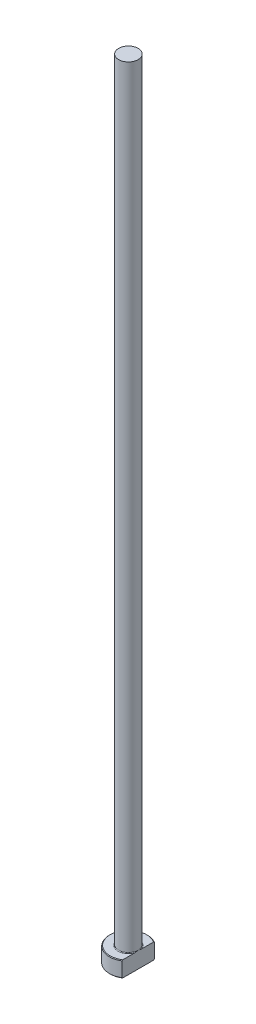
ISO-10303-21;
HEADER;
FILE_DESCRIPTION(('STEP AP214'),'2;1');
FILE_NAME('part.step','',(''),(''),'','','');
FILE_SCHEMA(('AUTOMOTIVE_DESIGN { 1 0 10303 214 1 1 1 1 }'));
ENDSEC;
DATA;
#1=APPLICATION_CONTEXT('core data for automotive mechanical design processes');
#2=APPLICATION_PROTOCOL_DEFINITION('international standard','automotive_design',2000,#1);
#3=PRODUCT_CONTEXT('',#1,'mechanical');
#4=PRODUCT('Part','Part','',(#3));
#5=PRODUCT_RELATED_PRODUCT_CATEGORY('part','',(#4));
#6=PRODUCT_DEFINITION_FORMATION('','',#4);
#7=PRODUCT_DEFINITION_CONTEXT('part definition',#1,'design');
#8=PRODUCT_DEFINITION('design','',#6,#7);
#9=PRODUCT_DEFINITION_SHAPE('','',#8);
#10=(LENGTH_UNIT() NAMED_UNIT(*) SI_UNIT(.MILLI.,.METRE.));
#11=(NAMED_UNIT(*) PLANE_ANGLE_UNIT() SI_UNIT($,.RADIAN.));
#12=(NAMED_UNIT(*) SI_UNIT($,.STERADIAN.) SOLID_ANGLE_UNIT());
#13=UNCERTAINTY_MEASURE_WITH_UNIT(LENGTH_MEASURE(1.E-05),#10,'distance_accuracy_value','');
#14=(GEOMETRIC_REPRESENTATION_CONTEXT(3) GLOBAL_UNCERTAINTY_ASSIGNED_CONTEXT((#13)) GLOBAL_UNIT_ASSIGNED_CONTEXT((#10,
#11,#12)) REPRESENTATION_CONTEXT('',''));
#15=CARTESIAN_POINT('',(0.,0.,0.));
#16=DIRECTION('',(0.,0.,1.));
#17=DIRECTION('',(1.,0.,0.));
#18=AXIS2_PLACEMENT_3D('',#15,#16,#17);
#19=CARTESIAN_POINT('',(0.,0.,0.));
#20=DIRECTION('',(0.,-1.,0.));
#21=DIRECTION('',(0.,0.,-1.));
#22=AXIS2_PLACEMENT_3D('',#19,#20,#21);
#23=PLANE('',#22);
#24=CARTESIAN_POINT('',(0.,0.,0.));
#25=DIRECTION('',(0.,-1.,0.));
#26=DIRECTION('',(0.,0.,-1.));
#27=AXIS2_PLACEMENT_3D('',#24,#25,#26);
#28=CIRCLE('',#27,5.79999999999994);
#29=CARTESIAN_POINT('',(3.09999999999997,0.,4.90204039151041));
#30=VERTEX_POINT('',#29);
#31=CARTESIAN_POINT('',(3.09999999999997,0.,-4.90204039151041));
#32=VERTEX_POINT('',#31);
#33=EDGE_CURVE('E98',#30,#32,#28,.T.);
#34=ORIENTED_EDGE('',*,*,#33,.T.);
#35=DIRECTION('',(0.,0.,1.));
#36=VECTOR('',#35,1.);
#37=CARTESIAN_POINT('',(3.09999999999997,0.,-5.13711981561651));
#38=LINE('',#37,#36);
#39=EDGE_CURVE('E83',#32,#30,#38,.T.);
#40=ORIENTED_EDGE('',*,*,#39,.T.);
#41=EDGE_LOOP('',(#34,#40));
#42=FACE_BOUND('',#41,.T.);
#43=ADVANCED_FACE('F32',(#42),#23,.T.);
#44=CARTESIAN_POINT('',(0.,259.958771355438,0.));
#45=DIRECTION('',(0.,1.,0.));
#46=DIRECTION('',(0.,0.,1.));
#47=AXIS2_PLACEMENT_3D('',#44,#45,#46);
#48=CYLINDRICAL_SURFACE('',#47,5.99999999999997);
#49=CARTESIAN_POINT('',(0.,4.80000000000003,0.));
#50=DIRECTION('',(0.,1.,0.));
#51=DIRECTION('',(0.,0.,1.));
#52=AXIS2_PLACEMENT_3D('',#49,#50,#51);
#53=CIRCLE('',#52,5.99999999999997);
#54=CARTESIAN_POINT('',(3.09999999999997,4.80000000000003,5.13711981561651));
#55=VERTEX_POINT('',#54);
#56=CARTESIAN_POINT('',(3.09999999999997,4.80000000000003,-5.13711981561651));
#57=VERTEX_POINT('',#56);
#58=EDGE_CURVE('E104',#55,#57,#53,.F.);
#59=ORIENTED_EDGE('',*,*,#58,.T.);
#60=DIRECTION('',(0.,-1.,0.));
#61=VECTOR('',#60,1.);
#62=CARTESIAN_POINT('',(3.09999999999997,250.,-5.13711981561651));
#63=LINE('',#62,#61);
#64=CARTESIAN_POINT('',(3.09999999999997,0.200000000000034,-5.13711981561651));
#65=VERTEX_POINT('',#64);
#66=EDGE_CURVE('E183',#57,#65,#63,.T.);
#67=ORIENTED_EDGE('',*,*,#66,.T.);
#68=CARTESIAN_POINT('',(0.,0.200000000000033,0.));
#69=DIRECTION('',(0.,-1.,0.));
#70=DIRECTION('',(0.,0.,-1.));
#71=AXIS2_PLACEMENT_3D('',#68,#69,#70);
#72=CIRCLE('',#71,5.99999999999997);
#73=CARTESIAN_POINT('',(3.09999999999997,0.200000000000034,5.13711981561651));
#74=VERTEX_POINT('',#73);
#75=EDGE_CURVE('E100',#65,#74,#72,.F.);
#76=ORIENTED_EDGE('',*,*,#75,.T.);
#77=DIRECTION('',(0.,-1.,0.));
#78=VECTOR('',#77,1.);
#79=CARTESIAN_POINT('',(3.09999999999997,250.,5.13711981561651));
#80=LINE('',#79,#78);
#81=EDGE_CURVE('E93',#55,#74,#80,.T.);
#82=ORIENTED_EDGE('',*,*,#81,.F.);
#83=EDGE_LOOP('',(#59,#67,#76,#82));
#84=FACE_BOUND('',#83,.T.);
#85=ADVANCED_FACE('F158',(#84),#48,.T.);
#86=CARTESIAN_POINT('',(-5.99999999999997,5.,0.));
#87=DIRECTION('',(0.,1.,0.));
#88=DIRECTION('',(0.,0.,1.));
#89=AXIS2_PLACEMENT_3D('',#86,#87,#88);
#90=PLANE('',#89);
#91=CARTESIAN_POINT('',(0.,5.,0.));
#92=DIRECTION('',(0.,1.,0.));
#93=DIRECTION('',(0.,0.,1.));
#94=AXIS2_PLACEMENT_3D('',#91,#92,#93);
#95=CIRCLE('',#94,5.79999999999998);
#96=CARTESIAN_POINT('',(3.09999999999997,5.,-4.90204039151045));
#97=VERTEX_POINT('',#96);
#98=CARTESIAN_POINT('',(3.09999999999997,5.,4.90204039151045));
#99=VERTEX_POINT('',#98);
#100=EDGE_CURVE('E178',#97,#99,#95,.T.);
#101=ORIENTED_EDGE('',*,*,#100,.T.);
#102=DIRECTION('',(0.,0.,-1.));
#103=VECTOR('',#102,1.);
#104=CARTESIAN_POINT('',(3.09999999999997,5.,0.));
#105=LINE('',#104,#103);
#106=CARTESIAN_POINT('',(3.09999999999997,4.99999999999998,1.13137084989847));
#107=VERTEX_POINT('',#106);
#108=EDGE_CURVE('E57',#99,#107,#105,.T.);
#109=ORIENTED_EDGE('',*,*,#108,.T.);
#110=CARTESIAN_POINT('',(0.,5.,0.));
#111=DIRECTION('',(0.,1.,0.));
#112=DIRECTION('',(0.,0.,1.));
#113=AXIS2_PLACEMENT_3D('',#110,#111,#112);
#114=CIRCLE('',#113,3.29999999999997);
#115=CARTESIAN_POINT('',(3.09999999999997,4.99999999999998,-1.13137084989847));
#116=VERTEX_POINT('',#115);
#117=EDGE_CURVE('E107',#107,#116,#114,.F.);
#118=ORIENTED_EDGE('',*,*,#117,.T.);
#119=EDGE_CURVE('E136',#116,#97,#105,.T.);
#120=ORIENTED_EDGE('',*,*,#119,.T.);
#121=EDGE_LOOP('',(#101,#109,#118,#120));
#122=FACE_BOUND('',#121,.T.);
#123=ADVANCED_FACE('F147',(#122),#90,.T.);
#124=CARTESIAN_POINT('',(0.,5.,0.));
#125=DIRECTION('',(0.,-1.,0.));
#126=DIRECTION('',(0.,0.,-1.));
#127=AXIS2_PLACEMENT_3D('',#124,#125,#126);
#128=CONICAL_SURFACE('',#127,5.79999999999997,0.785398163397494);
#129=ORIENTED_EDGE('',*,*,#58,.F.);
#130=CARTESIAN_POINT('',(3.09999999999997,-0.920431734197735,11.3030314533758));
#131=CARTESIAN_POINT('',(3.09999999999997,-0.688619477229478,11.0626468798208));
#132=CARTESIAN_POINT('',(3.09999999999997,-0.457063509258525,10.8220144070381));
#133=CARTESIAN_POINT('',(3.09999999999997,0.00539791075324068,10.3401205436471));
#134=CARTESIAN_POINT('',(3.09999999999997,0.236303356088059,10.0988591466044));
#135=CARTESIAN_POINT('',(3.09999999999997,0.69741098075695,9.61548494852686));
#136=CARTESIAN_POINT('',(3.09999999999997,0.927612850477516,9.3733718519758));
#137=CARTESIAN_POINT('',(3.09999999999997,1.38702344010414,8.88820676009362));
#138=CARTESIAN_POINT('',(3.09999999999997,1.61623216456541,8.64515476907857));
#139=CARTESIAN_POINT('',(3.09999999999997,2.06943803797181,8.16208218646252));
#140=CARTESIAN_POINT('',(3.09999999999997,2.29345676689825,7.92208185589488));
#141=CARTESIAN_POINT('',(3.09999999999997,2.73992554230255,7.4406269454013));
#142=CARTESIAN_POINT('',(3.09999999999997,2.96237559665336,7.19917237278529));
#143=CARTESIAN_POINT('',(3.09999999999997,3.40516728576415,6.71440911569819));
#144=CARTESIAN_POINT('',(3.09999999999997,3.6255092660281,6.47110074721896));
#145=CARTESIAN_POINT('',(3.09999999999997,4.06338097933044,5.98197014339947));
#146=CARTESIAN_POINT('',(3.09999999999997,4.28091078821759,5.736147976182));
#147=CARTESIAN_POINT('',(3.09999999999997,4.64723250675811,5.31542741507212));
#148=CARTESIAN_POINT('',(3.09999999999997,4.79703819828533,5.14141294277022));
#149=CARTESIAN_POINT('',(3.09999999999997,5.09412273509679,4.7912056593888));
#150=CARTESIAN_POINT('',(3.09999999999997,5.24140133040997,4.61501263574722));
#151=CARTESIAN_POINT('',(3.09999999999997,5.5340047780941,4.25808346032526));
#152=CARTESIAN_POINT('',(3.09999999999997,5.67929603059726,4.07731963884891));
#153=CARTESIAN_POINT('',(3.09999999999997,5.96506147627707,3.71208453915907));
#154=CARTESIAN_POINT('',(3.09999999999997,6.10553688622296,3.52761421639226));
#155=CARTESIAN_POINT('',(3.09999999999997,6.38162972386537,3.15098880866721));
#156=CARTESIAN_POINT('',(3.09999999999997,6.5171507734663,2.95876205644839));
#157=CARTESIAN_POINT('',(3.09999999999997,6.71260042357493,2.66498269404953));
#158=CARTESIAN_POINT('',(3.09999999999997,6.77649142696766,2.56607098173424));
#159=CARTESIAN_POINT('',(3.09999999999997,6.90093996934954,2.36617934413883));
#160=CARTESIAN_POINT('',(3.09999999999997,6.96149785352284,2.26519963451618));
#161=CARTESIAN_POINT('',(3.09999999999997,7.07778312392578,2.06197879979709));
#162=CARTESIAN_POINT('',(3.09999999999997,7.13355741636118,1.9597648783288));
#163=CARTESIAN_POINT('',(3.09999999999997,7.23993773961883,1.75269687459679));
#164=CARTESIAN_POINT('',(3.09999999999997,7.29054278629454,1.64784229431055));
#165=CARTESIAN_POINT('',(3.09999999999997,7.43232844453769,1.329374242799));
#166=CARTESIAN_POINT('',(3.09999999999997,7.51393038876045,1.11110705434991));
#167=CARTESIAN_POINT('',(3.09999999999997,7.60389052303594,0.78418122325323));
#168=CARTESIAN_POINT('',(3.09999999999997,7.62802295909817,0.679829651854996));
#169=CARTESIAN_POINT('',(3.09999999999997,7.66638713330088,0.46928482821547));
#170=CARTESIAN_POINT('',(3.09999999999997,7.68061997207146,0.363091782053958));
#171=CARTESIAN_POINT('',(3.09999999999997,7.69816738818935,0.150218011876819));
#172=CARTESIAN_POINT('',(3.09999999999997,7.70152516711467,0.0435409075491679));
#173=CARTESIAN_POINT('',(3.09999999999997,7.69719360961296,-0.169591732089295));
#174=CARTESIAN_POINT('',(3.09999999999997,7.68950359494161,-0.276047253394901));
#175=CARTESIAN_POINT('',(3.09999999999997,7.66373252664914,-0.486880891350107));
#176=CARTESIAN_POINT('',(3.09999999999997,7.64572733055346,-0.591268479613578));
#177=CARTESIAN_POINT('',(3.09999999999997,7.60052536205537,-0.798013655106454));
#178=CARTESIAN_POINT('',(3.09999999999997,7.57332729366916,-0.900370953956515));
#179=CARTESIAN_POINT('',(3.09999999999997,7.51094394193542,-1.10330613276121));
#180=CARTESIAN_POINT('',(3.09999999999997,7.47570859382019,-1.20386840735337));
#181=CARTESIAN_POINT('',(3.09999999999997,7.39875968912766,-1.40242722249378));
#182=CARTESIAN_POINT('',(3.09999999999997,7.35704736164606,-1.50042424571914));
#183=CARTESIAN_POINT('',(3.09999999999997,7.22811120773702,-1.78198575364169));
#184=CARTESIAN_POINT('',(3.09999999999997,7.13397777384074,-1.96237556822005));
#185=CARTESIAN_POINT('',(3.09999999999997,6.93309444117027,-2.31605883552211));
#186=CARTESIAN_POINT('',(3.09999999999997,6.82632930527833,-2.48934337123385));
#187=CARTESIAN_POINT('',(3.09999999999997,6.60386158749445,-2.83097436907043));
#188=CARTESIAN_POINT('',(3.09999999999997,6.48812633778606,-2.99929937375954));
#189=CARTESIAN_POINT('',(3.09999999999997,6.2507350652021,-3.33155975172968));
#190=CARTESIAN_POINT('',(3.09999999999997,6.12908188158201,-3.49549717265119));
#191=CARTESIAN_POINT('',(3.09999999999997,5.87989164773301,-3.82213838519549));
#192=CARTESIAN_POINT('',(3.09999999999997,5.75229938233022,-3.98479985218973));
#193=CARTESIAN_POINT('',(3.09999999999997,5.49383773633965,-4.30751445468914));
#194=CARTESIAN_POINT('',(3.09999999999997,5.36296802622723,-4.46756732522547));
#195=CARTESIAN_POINT('',(3.09999999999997,5.09906242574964,-4.78523580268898));
#196=CARTESIAN_POINT('',(3.09999999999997,4.96603235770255,-4.94285625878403));
#197=CARTESIAN_POINT('',(3.09999999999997,4.69805373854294,-5.25645943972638));
#198=CARTESIAN_POINT('',(3.09999999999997,4.56310515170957,-5.41244213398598));
#199=CARTESIAN_POINT('',(3.09999999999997,4.2080943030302,-5.81877937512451));
#200=CARTESIAN_POINT('',(3.09999999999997,3.98681570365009,-6.06807041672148));
#201=CARTESIAN_POINT('',(3.09999999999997,3.54147161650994,-6.56415415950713));
#202=CARTESIAN_POINT('',(3.09999999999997,3.31740605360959,-6.8109467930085));
#203=CARTESIAN_POINT('',(3.09999999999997,2.86701901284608,-7.30287446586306));
#204=CARTESIAN_POINT('',(3.09999999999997,2.64069567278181,-7.54800779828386));
#205=CARTESIAN_POINT('',(3.09999999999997,2.18649425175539,-8.0368296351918));
#206=CARTESIAN_POINT('',(3.09999999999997,1.95861616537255,-8.28051813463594));
#207=CARTESIAN_POINT('',(3.09999999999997,1.5108345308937,-8.75699429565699));
#208=CARTESIAN_POINT('',(3.09999999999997,1.29097841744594,-8.98982656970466));
#209=CARTESIAN_POINT('',(3.09999999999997,0.850379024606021,-9.4546514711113));
#210=CARTESIAN_POINT('',(3.09999999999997,0.629635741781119,-9.68664409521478));
#211=CARTESIAN_POINT('',(3.09999999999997,0.187673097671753,-10.1496925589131));
#212=CARTESIAN_POINT('',(3.09999999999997,-0.0335454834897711,-10.3807491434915));
#213=CARTESIAN_POINT('',(3.09999999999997,-0.476574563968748,-10.8422904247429));
#214=CARTESIAN_POINT('',(3.09999999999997,-0.698385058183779,-11.0727751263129));
#215=CARTESIAN_POINT('',(3.09999999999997,-0.920431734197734,-11.3030314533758));
#216=B_SPLINE_CURVE_WITH_KNOTS('',3,(#130,#131,#132,#133,#134,#135,#136,#137,#138,#139,#140,
#141,#142,#143,#144,#145,#146,#147,#148,#149,#150,#151,#152,#153,#154,#155,#156,#157,#158,#159,
#160,#161,#162,#163,#164,#165,#166,#167,#168,#169,#170,#171,#172,#173,#174,#175,#176,#177,#178,
#179,#180,#181,#182,#183,#184,#185,#186,#187,#188,#189,#190,#191,#192,#193,#194,#195,#196,#197,
#198,#199,#200,#201,#202,#203,#204,#205,#206,#207,#208,#209,#210,#211,#212,#213,#214,#215),
.UNSPECIFIED.,.F.,.F.,(4,2,2,2,2,2,2,2,2,2,2,2,2,2,2,2,2,2,2,2,2,2,2,2,2,2,2,2,2,2,2,2,2,2,2,2,
2,2,2,2,2,2,4),(0.,1.00184641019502,2.00370311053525,3.00595078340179,4.00819385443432,
4.9931053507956,5.97801190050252,6.9627541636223,7.94746981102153,8.6362949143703,
9.32518776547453,10.0208755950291,10.7163863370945,11.421700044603,11.7749044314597,
12.1280721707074,12.4772435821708,12.8264813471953,13.5223439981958,13.8432758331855,
14.1641719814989,14.4837917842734,14.8034312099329,15.1207496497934,15.4381128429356,
15.7575096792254,16.0768459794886,16.6863983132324,17.296693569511,17.9093265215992,
18.5216683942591,19.1418114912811,19.7620171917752,20.3807633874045,20.9995211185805,
21.9994842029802,22.9994743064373,24.0003716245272,25.0012724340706,25.961961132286,
26.9226535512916,27.882299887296,28.8419379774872),.UNSPECIFIED.);
#217=EDGE_CURVE('E135',#55,#99,#216,.T.);
#218=ORIENTED_EDGE('',*,*,#217,.T.);
#219=ORIENTED_EDGE('',*,*,#100,.F.);
#220=EDGE_CURVE('E127',#97,#57,#216,.T.);
#221=ORIENTED_EDGE('',*,*,#220,.T.);
#222=EDGE_LOOP('',(#129,#218,#219,#221));
#223=FACE_BOUND('',#222,.T.);
#224=ADVANCED_FACE('F143',(#223),#128,.T.);
#225=CARTESIAN_POINT('',(0.,0.200000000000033,0.));
#226=DIRECTION('',(0.,1.,0.));
#227=DIRECTION('',(0.,0.,1.));
#228=AXIS2_PLACEMENT_3D('',#225,#226,#227);
#229=CONICAL_SURFACE('',#228,5.99999999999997,0.785398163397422);
#230=ORIENTED_EDGE('',*,*,#75,.F.);
#231=CARTESIAN_POINT('',(3.09999999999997,5.92043173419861,-11.3030314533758));
#232=CARTESIAN_POINT('',(3.09999999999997,5.68861947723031,-11.0626468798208));
#233=CARTESIAN_POINT('',(3.09999999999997,5.4570635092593,-10.822014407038));
#234=CARTESIAN_POINT('',(3.09999999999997,4.99460208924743,-10.340120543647));
#235=CARTESIAN_POINT('',(3.09999999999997,4.76369664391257,-10.0988591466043));
#236=CARTESIAN_POINT('',(3.09999999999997,4.30258901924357,-9.61548494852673));
#237=CARTESIAN_POINT('',(3.09999999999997,4.07238714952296,-9.37337185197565));
#238=CARTESIAN_POINT('',(3.09999999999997,3.61297655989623,-8.88820676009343));
#239=CARTESIAN_POINT('',(3.09999999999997,3.38376783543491,-8.64515476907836));
#240=CARTESIAN_POINT('',(3.09999999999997,2.93056196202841,-8.16208218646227));
#241=CARTESIAN_POINT('',(3.09999999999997,2.70654323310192,-7.92208185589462));
#242=CARTESIAN_POINT('',(3.09999999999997,2.26007445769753,-7.44062694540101));
#243=CARTESIAN_POINT('',(3.09999999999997,2.03762440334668,-7.19917237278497));
#244=CARTESIAN_POINT('',(3.09999999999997,1.59483271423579,-6.71440911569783));
#245=CARTESIAN_POINT('',(3.09999999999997,1.3744907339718,-6.47110074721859));
#246=CARTESIAN_POINT('',(3.09999999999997,0.936619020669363,-5.98197014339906));
#247=CARTESIAN_POINT('',(3.09999999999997,0.71908921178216,-5.73614797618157));
#248=CARTESIAN_POINT('',(3.09999999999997,0.352767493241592,-5.31542741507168));
#249=CARTESIAN_POINT('',(3.09999999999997,0.202961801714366,-5.1414129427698));
#250=CARTESIAN_POINT('',(3.09999999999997,-0.094122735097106,-4.7912056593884));
#251=CARTESIAN_POINT('',(3.09999999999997,-0.241401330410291,-4.61501263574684));
#252=CARTESIAN_POINT('',(3.09999999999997,-0.534004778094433,-4.25808346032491));
#253=CARTESIAN_POINT('',(3.09999999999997,-0.679296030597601,-4.07731963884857));
#254=CARTESIAN_POINT('',(3.09999999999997,-0.965061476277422,-3.71208453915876));
#255=CARTESIAN_POINT('',(3.09999999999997,-1.10553688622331,-3.52761421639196));
#256=CARTESIAN_POINT('',(3.09999999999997,-1.38162972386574,-3.15098880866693));
#257=CARTESIAN_POINT('',(3.09999999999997,-1.51715077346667,-2.95876205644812));
#258=CARTESIAN_POINT('',(3.09999999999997,-1.71260042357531,-2.66498269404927));
#259=CARTESIAN_POINT('',(3.09999999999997,-1.77649142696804,-2.56607098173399));
#260=CARTESIAN_POINT('',(3.09999999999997,-1.90093996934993,-2.36617934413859));
#261=CARTESIAN_POINT('',(3.09999999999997,-1.96149785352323,-2.26519963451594));
#262=CARTESIAN_POINT('',(3.09999999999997,-2.07778312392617,-2.06197879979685));
#263=CARTESIAN_POINT('',(3.09999999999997,-2.13355741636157,-1.95976487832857));
#264=CARTESIAN_POINT('',(3.09999999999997,-2.23993773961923,-1.75269687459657));
#265=CARTESIAN_POINT('',(3.09999999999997,-2.29054278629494,-1.64784229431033));
#266=CARTESIAN_POINT('',(3.09999999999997,-2.43232844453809,-1.3293742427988));
#267=CARTESIAN_POINT('',(3.09999999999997,-2.51393038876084,-1.11110705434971));
#268=CARTESIAN_POINT('',(3.09999999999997,-2.60389052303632,-0.784181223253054));
#269=CARTESIAN_POINT('',(3.09999999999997,-2.62802295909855,-0.679829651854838));
#270=CARTESIAN_POINT('',(3.09999999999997,-2.66638713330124,-0.46928482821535));
#271=CARTESIAN_POINT('',(3.09999999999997,-2.68061997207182,-0.363091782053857));
#272=CARTESIAN_POINT('',(3.09999999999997,-2.69816738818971,-0.150218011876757));
#273=CARTESIAN_POINT('',(3.09999999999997,-2.70152516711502,-0.0435409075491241));
#274=CARTESIAN_POINT('',(3.09999999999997,-2.69719360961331,0.1695917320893));
#275=CARTESIAN_POINT('',(3.09999999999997,-2.68950359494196,0.276047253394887));
#276=CARTESIAN_POINT('',(3.09999999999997,-2.6637325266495,0.486880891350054));
#277=CARTESIAN_POINT('',(3.09999999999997,-2.64572733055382,0.591268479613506));
#278=CARTESIAN_POINT('',(3.09999999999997,-2.60052536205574,0.798013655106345));
#279=CARTESIAN_POINT('',(3.09999999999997,-2.57332729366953,0.900370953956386));
#280=CARTESIAN_POINT('',(3.09999999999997,-2.51094394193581,1.10330613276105));
#281=CARTESIAN_POINT('',(3.09999999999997,-2.47570859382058,1.20386840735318));
#282=CARTESIAN_POINT('',(3.09999999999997,-2.39875968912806,1.40242722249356));
#283=CARTESIAN_POINT('',(3.09999999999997,-2.35704736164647,1.5004242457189));
#284=CARTESIAN_POINT('',(3.09999999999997,-2.22811120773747,1.78198575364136));
#285=CARTESIAN_POINT('',(3.09999999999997,-2.13397777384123,1.96237556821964));
#286=CARTESIAN_POINT('',(3.09999999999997,-1.93309444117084,2.31605883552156));
#287=CARTESIAN_POINT('',(3.09999999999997,-1.82632930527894,2.48934337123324));
#288=CARTESIAN_POINT('',(3.09999999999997,-1.60386158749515,2.83097436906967));
#289=CARTESIAN_POINT('',(3.09999999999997,-1.48812633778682,2.99929937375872));
#290=CARTESIAN_POINT('',(3.09999999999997,-1.25073506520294,3.33155975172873));
#291=CARTESIAN_POINT('',(3.09999999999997,-1.1290818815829,3.49549717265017));
#292=CARTESIAN_POINT('',(3.09999999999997,-0.879891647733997,3.82213838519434));
#293=CARTESIAN_POINT('',(3.09999999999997,-0.752299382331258,3.98479985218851));
#294=CARTESIAN_POINT('',(3.09999999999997,-0.493837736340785,4.30751445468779));
#295=CARTESIAN_POINT('',(3.09999999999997,-0.362968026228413,4.46756732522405));
#296=CARTESIAN_POINT('',(3.09999999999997,-0.0990624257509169,4.78523580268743));
#297=CARTESIAN_POINT('',(3.09999999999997,0.033967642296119,4.94285625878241));
#298=CARTESIAN_POINT('',(3.09999999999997,0.301946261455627,5.25645943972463));
#299=CARTESIAN_POINT('',(3.09999999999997,0.436894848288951,5.41244213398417));
#300=CARTESIAN_POINT('',(3.09999999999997,0.791905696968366,5.81877937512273));
#301=CARTESIAN_POINT('',(3.09999999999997,1.01318429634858,6.06807041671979));
#302=CARTESIAN_POINT('',(3.09999999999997,1.45852838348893,6.56415415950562));
#303=CARTESIAN_POINT('',(3.09999999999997,1.68259394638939,6.81094679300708));
#304=CARTESIAN_POINT('',(3.09999999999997,2.13298098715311,7.30287446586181));
#305=CARTESIAN_POINT('',(3.09999999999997,2.35930432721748,7.54800779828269));
#306=CARTESIAN_POINT('',(3.09999999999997,2.81350574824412,8.03682963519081));
#307=CARTESIAN_POINT('',(3.09999999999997,3.04138383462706,8.28051813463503));
#308=CARTESIAN_POINT('',(3.09999999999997,3.48916546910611,8.75699429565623));
#309=CARTESIAN_POINT('',(3.09999999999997,3.70902158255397,8.98982656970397));
#310=CARTESIAN_POINT('',(3.09999999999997,4.14962097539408,9.45465147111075));
#311=CARTESIAN_POINT('',(3.09999999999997,4.37036425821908,9.6866440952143));
#312=CARTESIAN_POINT('',(3.09999999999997,4.81232690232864,10.1496925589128));
#313=CARTESIAN_POINT('',(3.09999999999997,5.03354548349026,10.3807491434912));
#314=CARTESIAN_POINT('',(3.09999999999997,5.47657456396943,10.8422904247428));
#315=CARTESIAN_POINT('',(3.09999999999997,5.69838505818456,11.0727751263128));
#316=CARTESIAN_POINT('',(3.09999999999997,5.92043173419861,11.3030314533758));
#317=B_SPLINE_CURVE_WITH_KNOTS('',3,(#231,#232,#233,#234,#235,#236,#237,#238,#239,#240,#241,
#242,#243,#244,#245,#246,#247,#248,#249,#250,#251,#252,#253,#254,#255,#256,#257,#258,#259,#260,
#261,#262,#263,#264,#265,#266,#267,#268,#269,#270,#271,#272,#273,#274,#275,#276,#277,#278,#279,
#280,#281,#282,#283,#284,#285,#286,#287,#288,#289,#290,#291,#292,#293,#294,#295,#296,#297,#298,
#299,#300,#301,#302,#303,#304,#305,#306,#307,#308,#309,#310,#311,#312,#313,#314,#315,#316),
.UNSPECIFIED.,.F.,.F.,(4,2,2,2,2,2,2,2,2,2,2,2,2,2,2,2,2,2,2,2,2,2,2,2,2,2,2,2,2,2,2,2,2,2,2,2,
2,2,2,2,2,2,4),(0.,1.00184641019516,2.00370311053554,3.00595078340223,4.00819385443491,
4.99310535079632,5.97801190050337,6.96275416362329,7.94746981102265,8.6362949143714,
9.32518776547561,10.0208755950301,10.7163863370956,11.421700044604,11.7749044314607,
12.1280721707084,12.4772435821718,12.8264813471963,13.5223439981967,13.8432758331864,
14.1641719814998,14.4837917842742,14.8034312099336,15.1207496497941,15.4381128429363,
15.757509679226,16.0768459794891,16.6863983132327,17.2966935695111,17.909326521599,
18.5216683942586,19.1418114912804,19.7620171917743,20.3807633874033,20.999521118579,
21.9994842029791,22.9994743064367,24.000371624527,25.0012724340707,25.9619611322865,
26.9226535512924,27.8822998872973,28.8419379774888),.UNSPECIFIED.);
#318=EDGE_CURVE('E86',#65,#32,#317,.T.);
#319=ORIENTED_EDGE('',*,*,#318,.T.);
#320=ORIENTED_EDGE('',*,*,#33,.F.);
#321=EDGE_CURVE('E89',#30,#74,#317,.T.);
#322=ORIENTED_EDGE('',*,*,#321,.T.);
#323=EDGE_LOOP('',(#230,#319,#320,#322));
#324=FACE_BOUND('',#323,.T.);
#325=ADVANCED_FACE('F97',(#324),#229,.T.);
#326=CARTESIAN_POINT('',(0.,5.19999999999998,0.));
#327=DIRECTION('',(0.,1.,0.));
#328=DIRECTION('',(0.,0.,1.));
#329=AXIS2_PLACEMENT_3D('',#326,#327,#328);
#330=TOROIDAL_SURFACE('',#329,3.29999999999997,0.2);
#331=CARTESIAN_POINT('',(3.09999999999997,5.19999999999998,0.));
#332=CARTESIAN_POINT('',(3.09999999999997,5.20000050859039,8.63470448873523E-11));
#333=CARTESIAN_POINT('',(3.09999999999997,5.20000101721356,-1.96831350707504E-07));
#334=CARTESIAN_POINT('',(3.09999999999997,5.20000196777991,-7.43387548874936E-07));
#335=CARTESIAN_POINT('',(3.09999999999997,5.20000239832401,-1.10608751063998E-06));
#336=CARTESIAN_POINT('',(3.09999999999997,5.20000329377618,-1.97482885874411E-06));
#337=CARTESIAN_POINT('',(3.09999999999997,5.20000374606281,-2.49491365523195E-06));
#338=CARTESIAN_POINT('',(3.09999999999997,5.20000455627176,-3.57320004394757E-06));
#339=CARTESIAN_POINT('',(3.09999999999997,5.20000491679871,-4.12959627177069E-06));
#340=CARTESIAN_POINT('',(3.09999999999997,5.20000625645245,-6.28443543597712E-06));
#341=CARTESIAN_POINT('',(3.09999999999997,5.20000716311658,-7.93057681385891E-06));
#342=CARTESIAN_POINT('',(3.09999999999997,5.20000865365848,-1.11908861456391E-05));
#343=CARTESIAN_POINT('',(3.09999999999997,5.20000925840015,-1.27959111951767E-05));
#344=CARTESIAN_POINT('',(3.09999999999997,5.20001179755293,-1.95895744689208E-05));
#345=CARTESIAN_POINT('',(3.09999999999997,5.20001369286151,-2.47960258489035E-05));
#346=CARTESIAN_POINT('',(3.09999999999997,5.20001648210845,-3.46313916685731E-05));
#347=CARTESIAN_POINT('',(3.09999999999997,5.20001748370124,-3.9229578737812E-05));
#348=CARTESIAN_POINT('',(3.09999999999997,5.20002478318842,-7.34062169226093E-05));
#349=CARTESIAN_POINT('',(3.09999999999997,5.20003031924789,-0.000103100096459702));
#350=CARTESIAN_POINT('',(3.09999999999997,5.20005455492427,-0.000220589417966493));
#351=CARTESIAN_POINT('',(3.09999999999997,5.2000776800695,-0.000307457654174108));
#352=CARTESIAN_POINT('',(3.09999999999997,5.20016786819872,-0.000651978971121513));
#353=CARTESIAN_POINT('',(3.09999999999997,5.20023206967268,-0.000910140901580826));
#354=CARTESIAN_POINT('',(3.09999999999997,5.2004894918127,-0.00193760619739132));
#355=CARTESIAN_POINT('',(3.09999999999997,5.20068632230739,-0.00270624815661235));
#356=CARTESIAN_POINT('',(3.09999999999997,5.20150547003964,-0.00591366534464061));
#357=CARTESIAN_POINT('',(3.09999999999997,5.20212323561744,-0.00835327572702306));
#358=CARTESIAN_POINT('',(3.09999999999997,5.2072994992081,-0.0287840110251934));
#359=CARTESIAN_POINT('',(3.09999999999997,5.21187465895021,-0.046772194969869));
#360=CARTESIAN_POINT('',(3.09999999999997,5.22081406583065,-0.0820386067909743));
#361=CARTESIAN_POINT('',(3.09999999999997,5.22517945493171,-0.0993165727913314));
#362=CARTESIAN_POINT('',(3.09999999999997,5.23938711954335,-0.155760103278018));
#363=CARTESIAN_POINT('',(3.09999999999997,5.24916620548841,-0.19494192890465));
#364=CARTESIAN_POINT('',(3.09999999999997,5.26559812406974,-0.262010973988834));
#365=CARTESIAN_POINT('',(3.09999999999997,5.27233495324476,-0.289877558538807));
#366=CARTESIAN_POINT('',(3.09999999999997,5.28539894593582,-0.344925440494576));
#367=CARTESIAN_POINT('',(3.09999999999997,5.2917322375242,-0.372105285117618));
#368=CARTESIAN_POINT('',(3.09999999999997,5.3104657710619,-0.454441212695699));
#369=CARTESIAN_POINT('',(3.09999999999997,5.32242624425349,-0.509699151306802));
#370=CARTESIAN_POINT('',(3.09999999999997,5.34470875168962,-0.621095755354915));
#371=CARTESIAN_POINT('',(3.09999999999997,5.35501420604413,-0.677237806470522));
#372=CARTESIAN_POINT('',(3.09999999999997,5.37397233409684,-0.795308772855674));
#373=CARTESIAN_POINT('',(3.09999999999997,5.38237372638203,-0.857279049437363));
#374=CARTESIAN_POINT('',(3.09999999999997,5.39483964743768,-0.981488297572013));
#375=CARTESIAN_POINT('',(3.09999999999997,5.39891956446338,-1.04372551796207));
#376=CARTESIAN_POINT('',(3.09999999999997,5.4002522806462,-1.1364625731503));
#377=CARTESIAN_POINT('',(3.09999999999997,5.39992868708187,-1.16692514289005));
#378=CARTESIAN_POINT('',(3.09999999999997,5.39736890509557,-1.22783403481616));
#379=CARTESIAN_POINT('',(3.09999999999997,5.39512949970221,-1.25828024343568));
#380=CARTESIAN_POINT('',(3.09999999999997,5.3882758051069,-1.31816284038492));
#381=CARTESIAN_POINT('',(3.09999999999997,5.38372059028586,-1.34760578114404));
#382=CARTESIAN_POINT('',(3.09999999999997,5.37149785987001,-1.40581436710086));
#383=CARTESIAN_POINT('',(3.09999999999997,5.36383981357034,-1.43458179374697));
#384=CARTESIAN_POINT('',(3.09999999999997,5.34913051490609,-1.47610977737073));
#385=CARTESIAN_POINT('',(3.09999999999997,5.34380195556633,-1.48947638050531));
#386=CARTESIAN_POINT('',(3.09999999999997,5.33179609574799,-1.51565425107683));
#387=CARTESIAN_POINT('',(3.09999999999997,5.32511527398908,-1.52846396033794));
#388=CARTESIAN_POINT('',(3.09999999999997,5.31156812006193,-1.55058530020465));
#389=CARTESIAN_POINT('',(3.09999999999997,5.30500876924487,-1.56008264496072));
#390=CARTESIAN_POINT('',(3.09999999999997,5.29056237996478,-1.5780097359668));
#391=CARTESIAN_POINT('',(3.09999999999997,5.28267975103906,-1.58644287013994));
#392=CARTESIAN_POINT('',(3.09999999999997,5.26899499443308,-1.59836257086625));
#393=CARTESIAN_POINT('',(3.09999999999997,5.26370979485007,-1.60243897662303));
#394=CARTESIAN_POINT('',(3.09999999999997,5.25259769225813,-1.60977856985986));
#395=CARTESIAN_POINT('',(3.09999999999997,5.24677147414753,-1.61304276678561));
#396=CARTESIAN_POINT('',(3.09999999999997,5.23558966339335,-1.61807105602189));
#397=CARTESIAN_POINT('',(3.09999999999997,5.23030479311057,-1.61999055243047));
#398=CARTESIAN_POINT('',(3.09999999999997,5.21948724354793,-1.62291762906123));
#399=CARTESIAN_POINT('',(3.09999999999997,5.21395478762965,-1.62392601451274));
#400=CARTESIAN_POINT('',(3.09999999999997,5.20277366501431,-1.62493544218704));
#401=CARTESIAN_POINT('',(3.09999999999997,5.19712461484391,-1.62493233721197));
#402=CARTESIAN_POINT('',(3.09999999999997,5.18591949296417,-1.62390846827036));
#403=CARTESIAN_POINT('',(3.09999999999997,5.1803634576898,-1.62288731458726));
#404=CARTESIAN_POINT('',(3.09999999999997,5.16982009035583,-1.62001450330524));
#405=CARTESIAN_POINT('',(3.09999999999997,5.16481843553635,-1.61821408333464));
#406=CARTESIAN_POINT('',(3.09999999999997,5.15512149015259,-1.61392929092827));
#407=CARTESIAN_POINT('',(3.09999999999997,5.15042629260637,-1.61144471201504));
#408=CARTESIAN_POINT('',(3.09999999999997,5.13843536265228,-1.60413057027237));
#409=CARTESIAN_POINT('',(3.09999999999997,5.13143004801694,-1.59882575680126));
#410=CARTESIAN_POINT('',(3.09999999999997,5.11831643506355,-1.5871999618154));
#411=CARTESIAN_POINT('',(3.09999999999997,5.1122112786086,-1.58087557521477));
#412=CARTESIAN_POINT('',(3.09999999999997,5.09648912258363,-1.56251896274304));
#413=CARTESIAN_POINT('',(3.09999999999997,5.08770172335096,-1.54978301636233));
#414=CARTESIAN_POINT('',(3.09999999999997,5.07201622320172,-1.52323986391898));
#415=CARTESIAN_POINT('',(3.09999999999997,5.06512028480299,-1.50943145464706));
#416=CARTESIAN_POINT('',(3.09999999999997,5.05247518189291,-1.48047677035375));
#417=CARTESIAN_POINT('',(3.09999999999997,5.04680124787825,-1.46529814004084));
#418=CARTESIAN_POINT('',(3.09999999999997,5.03672275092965,-1.43451819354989));
#419=CARTESIAN_POINT('',(3.09999999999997,5.03231964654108,-1.41891641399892));
#420=CARTESIAN_POINT('',(3.09999999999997,5.02058030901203,-1.37142005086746));
#421=CARTESIAN_POINT('',(3.09999999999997,5.01483238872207,-1.3391366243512));
#422=CARTESIAN_POINT('',(3.09999999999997,5.00376797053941,-1.25503165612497));
#423=CARTESIAN_POINT('',(3.09999999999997,5.00071471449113,-1.20294070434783));
#424=CARTESIAN_POINT('',(3.09999999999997,4.99950954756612,-1.09856941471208));
#425=CARTESIAN_POINT('',(3.09999999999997,5.00137734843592,-1.04628915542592));
#426=CARTESIAN_POINT('',(3.09999999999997,5.00844280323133,-0.944923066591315));
#427=CARTESIAN_POINT('',(3.09999999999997,5.01344756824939,-0.895822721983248));
#428=CARTESIAN_POINT('',(3.09999999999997,5.02575896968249,-0.798308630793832));
#429=CARTESIAN_POINT('',(3.09999999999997,5.03304750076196,-0.749892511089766));
#430=CARTESIAN_POINT('',(3.09999999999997,5.04953811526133,-0.652335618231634));
#431=CARTESIAN_POINT('',(3.09999999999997,5.05877753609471,-0.603201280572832));
#432=CARTESIAN_POINT('',(3.09999999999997,5.07884455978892,-0.503941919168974));
#433=CARTESIAN_POINT('',(3.09999999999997,5.08970698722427,-0.453824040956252));
#434=CARTESIAN_POINT('',(3.09999999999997,5.10895219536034,-0.369008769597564));
#435=CARTESIAN_POINT('',(3.09999999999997,5.11708529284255,-0.334253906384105));
#436=CARTESIAN_POINT('',(3.09999999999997,5.13360118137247,-0.265211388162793));
#437=CARTESIAN_POINT('',(3.09999999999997,5.14198019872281,-0.230922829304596));
#438=CARTESIAN_POINT('',(3.09999999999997,5.15798158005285,-0.16629806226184));
#439=CARTESIAN_POINT('',(3.09999999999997,5.16558151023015,-0.135956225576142));
#440=CARTESIAN_POINT('',(3.09999999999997,5.1812139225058,-0.0740081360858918));
#441=CARTESIAN_POINT('',(3.09999999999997,5.18925105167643,-0.0424030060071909));
#442=CARTESIAN_POINT('',(3.09999999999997,5.19787768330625,-0.0083493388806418));
#443=CARTESIAN_POINT('',(3.09999999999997,5.1984965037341,-0.00590581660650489));
#444=CARTESIAN_POINT('',(3.09999999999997,5.19931589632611,-0.00269751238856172));
#445=CARTESIAN_POINT('',(3.09999999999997,5.19951194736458,-0.00193190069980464));
#446=CARTESIAN_POINT('',(3.09999999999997,5.1997684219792,-0.000908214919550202));
#447=CARTESIAN_POINT('',(3.09999999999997,5.19983243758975,-0.000650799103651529));
#448=CARTESIAN_POINT('',(3.09999999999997,5.19992240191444,-0.00030714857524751));
#449=CARTESIAN_POINT('',(3.09999999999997,5.19994549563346,-0.000220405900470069));
#450=CARTESIAN_POINT('',(3.09999999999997,5.19996970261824,-0.000103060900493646));
#451=CARTESIAN_POINT('',(3.09999999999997,5.19997523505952,-7.33845004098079E-05));
#452=CARTESIAN_POINT('',(3.09999999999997,5.19998252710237,-3.92257131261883E-05));
#453=CARTESIAN_POINT('',(3.09999999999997,5.19998352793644,-3.462848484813E-05));
#454=CARTESIAN_POINT('',(3.09999999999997,5.1999863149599,-2.4795096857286E-05));
#455=CARTESIAN_POINT('',(3.09999999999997,5.19998820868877,-1.95896135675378E-05));
#456=CARTESIAN_POINT('',(3.09999999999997,5.19999074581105,-1.2796958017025E-05));
#457=CARTESIAN_POINT('',(3.09999999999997,5.1999913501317,-1.11920046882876E-05));
#458=CARTESIAN_POINT('',(3.09999999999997,5.19999283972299,-7.93177065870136E-06));
#459=CARTESIAN_POINT('',(3.09999999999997,5.19999374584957,-6.28562370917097E-06));
#460=CARTESIAN_POINT('',(3.09999999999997,5.19999508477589,-4.13069797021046E-06));
#461=CARTESIAN_POINT('',(3.09999999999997,5.1999954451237,-3.57425625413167E-06));
#462=CARTESIAN_POINT('',(3.09999999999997,5.19999625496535,-2.49584654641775E-06));
#463=CARTESIAN_POINT('',(3.09999999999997,5.19999670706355,-1.97568269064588E-06));
#464=CARTESIAN_POINT('',(3.09999999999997,5.19999760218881,-1.10675611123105E-06));
#465=CARTESIAN_POINT('',(3.09999999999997,5.19999803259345,-7.4395710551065E-07));
#466=CARTESIAN_POINT('',(3.09999999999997,5.19999898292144,-1.97149804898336E-07));
#467=CARTESIAN_POINT('',(3.09999999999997,5.19999949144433,-8.63411446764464E-11));
#468=CARTESIAN_POINT('',(3.09999999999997,5.19999999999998,0.));
#469=B_SPLINE_CURVE_WITH_KNOTS('',3,(#331,#332,#333,#334,#335,#336,#337,#338,#339,#340,#341,
#342,#343,#344,#345,#346,#347,#348,#349,#350,#351,#352,#353,#354,#355,#356,#357,#358,#359,#360,
#361,#362,#363,#364,#365,#366,#367,#368,#369,#370,#371,#372,#373,#374,#375,#376,#377,#378,#379,
#380,#381,#382,#383,#384,#385,#386,#387,#388,#389,#390,#391,#392,#393,#394,#395,#396,#397,#398,
#399,#400,#401,#402,#403,#404,#405,#406,#407,#408,#409,#410,#411,#412,#413,#414,#415,#416,#417,
#418,#419,#420,#421,#422,#423,#424,#425,#426,#427,#428,#429,#430,#431,#432,#433,#434,#435,#436,
#437,#438,#439,#440,#441,#442,#443,#444,#445,#446,#447,#448,#449,#450,#451,#452,#453,#454,#455,
#456,#457,#458,#459,#460,#461,#462,#463,#464,#465,#466,#467,#468),.UNSPECIFIED.,.T.,.F.,(4,2,2,
2,2,2,2,2,2,2,2,2,2,2,2,2,2,2,2,2,2,2,2,2,2,2,2,2,2,2,2,2,2,2,2,2,2,2,2,2,2,2,2,2,2,2,2,2,2,2,2,
2,2,2,2,2,2,2,2,2,2,2,2,2,2,2,2,2,4),(0.,1.53981331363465E-06,3.23033975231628E-06,
5.28553578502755E-06,7.27344647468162E-06,1.28910817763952E-05,1.8031960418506E-05,
3.46255039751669E-05,4.8726433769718E-05,0.000139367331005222,0.000408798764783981,
0.0012071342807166,0.00358714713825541,0.0111373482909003,0.0668184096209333,0.120281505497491,
0.241431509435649,0.327438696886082,0.411161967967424,0.580755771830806,0.751954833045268,
0.939477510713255,1.12633017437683,1.21767988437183,1.30918328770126,1.39846159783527,
1.48746947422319,1.53058836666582,1.57382101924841,1.60836719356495,1.64280045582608,
1.66276990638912,1.68271441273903,1.69951299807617,1.71629672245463,1.73314926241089,
1.75000825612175,1.76589594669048,1.78178843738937,1.80799762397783,1.83429622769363,
1.88045465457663,1.9266656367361,1.97520355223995,2.02379695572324,2.12194851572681,
2.27811623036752,2.43491043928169,2.58289937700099,2.7297435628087,2.87970504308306,
3.03353547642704,3.14061512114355,3.24650617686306,3.34034416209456,3.4381742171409,
3.44573655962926,3.44810718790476,3.44890321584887,3.44917225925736,3.44926284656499,
3.44927694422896,3.44929353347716,3.44929867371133,3.44930429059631,3.44930627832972,
3.44930833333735,3.44931002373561,3.4493115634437),.UNSPECIFIED.);
#470=CARTESIAN_POINT('',(3.09999999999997,5.19999999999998,0.));
#471=VERTEX_POINT('',#470);
#472=EDGE_CURVE('E11',#116,#471,#469,.T.);
#473=ORIENTED_EDGE('',*,*,#472,.F.);
#474=ORIENTED_EDGE('',*,*,#117,.F.);
#475=CARTESIAN_POINT('',(3.09999999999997,5.19999999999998,0.));
#476=CARTESIAN_POINT('',(3.09999999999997,5.19999949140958,-8.63470557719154E-11));
#477=CARTESIAN_POINT('',(3.09999999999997,5.19999898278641,1.96831350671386E-07));
#478=CARTESIAN_POINT('',(3.09999999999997,5.19999803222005,7.43387548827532E-07));
#479=CARTESIAN_POINT('',(3.09999999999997,5.19999760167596,1.10608751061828E-06));
#480=CARTESIAN_POINT('',(3.09999999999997,5.19999670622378,1.97482885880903E-06));
#481=CARTESIAN_POINT('',(3.09999999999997,5.19999625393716,2.49491365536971E-06));
#482=CARTESIAN_POINT('',(3.09999999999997,5.1999954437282,3.57320004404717E-06));
#483=CARTESIAN_POINT('',(3.09999999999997,5.19999508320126,4.12959627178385E-06));
#484=CARTESIAN_POINT('',(3.09999999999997,5.19999374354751,6.28443543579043E-06));
#485=CARTESIAN_POINT('',(3.09999999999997,5.19999283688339,7.93057681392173E-06));
#486=CARTESIAN_POINT('',(3.09999999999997,5.19999134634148,1.1190886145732E-05));
#487=CARTESIAN_POINT('',(3.09999999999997,5.19999074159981,1.27959111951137E-05));
#488=CARTESIAN_POINT('',(3.09999999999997,5.19998820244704,1.95895744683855E-05));
#489=CARTESIAN_POINT('',(3.09999999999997,5.19998630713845,2.47960258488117E-05));
#490=CARTESIAN_POINT('',(3.09999999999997,5.19998351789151,3.4631391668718E-05));
#491=CARTESIAN_POINT('',(3.09999999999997,5.19998251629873,3.9229578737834E-05));
#492=CARTESIAN_POINT('',(3.09999999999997,5.19997521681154,7.34062169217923E-05));
#493=CARTESIAN_POINT('',(3.09999999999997,5.19996968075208,0.000103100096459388));
#494=CARTESIAN_POINT('',(3.09999999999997,5.1999454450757,0.000220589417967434));
#495=CARTESIAN_POINT('',(3.09999999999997,5.19992231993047,0.000307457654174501));
#496=CARTESIAN_POINT('',(3.09999999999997,5.19983213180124,0.000651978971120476));
#497=CARTESIAN_POINT('',(3.09999999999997,5.19976793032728,0.00091014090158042));
#498=CARTESIAN_POINT('',(3.09999999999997,5.19951050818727,0.00193760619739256));
#499=CARTESIAN_POINT('',(3.09999999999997,5.19931367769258,0.00270624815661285));
#500=CARTESIAN_POINT('',(3.09999999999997,5.19849452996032,0.00591366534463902));
#501=CARTESIAN_POINT('',(3.09999999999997,5.19787676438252,0.00835327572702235));
#502=CARTESIAN_POINT('',(3.09999999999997,5.19270050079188,0.0287840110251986));
#503=CARTESIAN_POINT('',(3.09999999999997,5.18812534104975,0.0467721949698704));
#504=CARTESIAN_POINT('',(3.09999999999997,5.17918593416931,0.0820386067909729));
#505=CARTESIAN_POINT('',(3.09999999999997,5.17482054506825,0.0993165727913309));
#506=CARTESIAN_POINT('',(3.09999999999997,5.16061288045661,0.15576010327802));
#507=CARTESIAN_POINT('',(3.09999999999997,5.15083379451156,0.194941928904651));
#508=CARTESIAN_POINT('',(3.09999999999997,5.13440187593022,0.262010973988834));
#509=CARTESIAN_POINT('',(3.09999999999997,5.12766504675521,0.289877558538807));
#510=CARTESIAN_POINT('',(3.09999999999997,5.11460105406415,0.344925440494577));
#511=CARTESIAN_POINT('',(3.09999999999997,5.10826776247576,0.372105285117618));
#512=CARTESIAN_POINT('',(3.09999999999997,5.08953422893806,0.454441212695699));
#513=CARTESIAN_POINT('',(3.09999999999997,5.07757375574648,0.509699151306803));
#514=CARTESIAN_POINT('',(3.09999999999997,5.05529124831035,0.621095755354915));
#515=CARTESIAN_POINT('',(3.09999999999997,5.04498579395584,0.677237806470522));
#516=CARTESIAN_POINT('',(3.09999999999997,5.02602766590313,0.795308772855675));
#517=CARTESIAN_POINT('',(3.09999999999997,5.01762627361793,0.857279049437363));
#518=CARTESIAN_POINT('',(3.09999999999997,5.00516035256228,0.981488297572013));
#519=CARTESIAN_POINT('',(3.09999999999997,5.00108043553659,1.04372551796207));
#520=CARTESIAN_POINT('',(3.09999999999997,4.99974771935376,1.1364625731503));
#521=CARTESIAN_POINT('',(3.09999999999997,5.0000713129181,1.16692514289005));
#522=CARTESIAN_POINT('',(3.09999999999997,5.00263109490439,1.22783403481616));
#523=CARTESIAN_POINT('',(3.09999999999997,5.00487050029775,1.25828024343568));
#524=CARTESIAN_POINT('',(3.09999999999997,5.01172419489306,1.31816284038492));
#525=CARTESIAN_POINT('',(3.09999999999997,5.0162794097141,1.34760578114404));
#526=CARTESIAN_POINT('',(3.09999999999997,5.02850214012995,1.40581436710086));
#527=CARTESIAN_POINT('',(3.09999999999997,5.03616018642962,1.43458179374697));
#528=CARTESIAN_POINT('',(3.09999999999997,5.05086948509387,1.47610977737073));
#529=CARTESIAN_POINT('',(3.09999999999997,5.05619804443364,1.48947638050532));
#530=CARTESIAN_POINT('',(3.09999999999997,5.06820390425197,1.51565425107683));
#531=CARTESIAN_POINT('',(3.09999999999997,5.07488472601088,1.52846396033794));
#532=CARTESIAN_POINT('',(3.09999999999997,5.08843187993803,1.55058530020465));
#533=CARTESIAN_POINT('',(3.09999999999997,5.0949912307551,1.56008264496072));
#534=CARTESIAN_POINT('',(3.09999999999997,5.10943762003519,1.5780097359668));
#535=CARTESIAN_POINT('',(3.09999999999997,5.11732024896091,1.58644287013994));
#536=CARTESIAN_POINT('',(3.09999999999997,5.13100500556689,1.59836257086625));
#537=CARTESIAN_POINT('',(3.09999999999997,5.1362902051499,1.60243897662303));
#538=CARTESIAN_POINT('',(3.09999999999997,5.14740230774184,1.60977856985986));
#539=CARTESIAN_POINT('',(3.09999999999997,5.15322852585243,1.61304276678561));
#540=CARTESIAN_POINT('',(3.09999999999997,5.16441033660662,1.61807105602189));
#541=CARTESIAN_POINT('',(3.09999999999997,5.16969520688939,1.61999055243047));
#542=CARTESIAN_POINT('',(3.09999999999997,5.18051275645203,1.62291762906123));
#543=CARTESIAN_POINT('',(3.09999999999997,5.18604521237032,1.62392601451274));
#544=CARTESIAN_POINT('',(3.09999999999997,5.19722633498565,1.62493544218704));
#545=CARTESIAN_POINT('',(3.09999999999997,5.20287538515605,1.62493233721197));
#546=CARTESIAN_POINT('',(3.09999999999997,5.21408050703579,1.62390846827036));
#547=CARTESIAN_POINT('',(3.09999999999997,5.21963654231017,1.62288731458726));
#548=CARTESIAN_POINT('',(3.09999999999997,5.23017990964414,1.62001450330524));
#549=CARTESIAN_POINT('',(3.09999999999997,5.23518156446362,1.61821408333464));
#550=CARTESIAN_POINT('',(3.09999999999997,5.24487850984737,1.61392929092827));
#551=CARTESIAN_POINT('',(3.09999999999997,5.2495737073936,1.61144471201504));
#552=CARTESIAN_POINT('',(3.09999999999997,5.26156463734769,1.60413057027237));
#553=CARTESIAN_POINT('',(3.09999999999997,5.26856995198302,1.59882575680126));
#554=CARTESIAN_POINT('',(3.09999999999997,5.28168356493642,1.5871999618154));
#555=CARTESIAN_POINT('',(3.09999999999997,5.28778872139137,1.58087557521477));
#556=CARTESIAN_POINT('',(3.09999999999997,5.30351087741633,1.56251896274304));
#557=CARTESIAN_POINT('',(3.09999999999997,5.312298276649,1.54978301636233));
#558=CARTESIAN_POINT('',(3.09999999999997,5.32798377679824,1.52323986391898));
#559=CARTESIAN_POINT('',(3.09999999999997,5.33487971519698,1.50943145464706));
#560=CARTESIAN_POINT('',(3.09999999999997,5.34752481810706,1.48047677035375));
#561=CARTESIAN_POINT('',(3.09999999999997,5.35319875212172,1.46529814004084));
#562=CARTESIAN_POINT('',(3.09999999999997,5.36327724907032,1.43451819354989));
#563=CARTESIAN_POINT('',(3.09999999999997,5.36768035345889,1.41891641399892));
#564=CARTESIAN_POINT('',(3.09999999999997,5.37941969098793,1.37142005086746));
#565=CARTESIAN_POINT('',(3.09999999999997,5.3851676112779,1.33913662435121));
#566=CARTESIAN_POINT('',(3.09999999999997,5.39623202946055,1.25503165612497));
#567=CARTESIAN_POINT('',(3.09999999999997,5.39928528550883,1.20294070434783));
#568=CARTESIAN_POINT('',(3.09999999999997,5.40049045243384,1.09856941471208));
#569=CARTESIAN_POINT('',(3.09999999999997,5.39862265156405,1.04628915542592));
#570=CARTESIAN_POINT('',(3.09999999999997,5.39155719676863,0.944923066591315));
#571=CARTESIAN_POINT('',(3.09999999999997,5.38655243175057,0.895822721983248));
#572=CARTESIAN_POINT('',(3.09999999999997,5.37424103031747,0.798308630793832));
#573=CARTESIAN_POINT('',(3.09999999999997,5.36695249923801,0.749892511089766));
#574=CARTESIAN_POINT('',(3.09999999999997,5.35046188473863,0.652335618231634));
#575=CARTESIAN_POINT('',(3.09999999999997,5.34122246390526,0.603201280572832));
#576=CARTESIAN_POINT('',(3.09999999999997,5.32115544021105,0.503941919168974));
#577=CARTESIAN_POINT('',(3.09999999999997,5.3102930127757,0.453824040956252));
#578=CARTESIAN_POINT('',(3.09999999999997,5.29104780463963,0.369008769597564));
#579=CARTESIAN_POINT('',(3.09999999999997,5.28291470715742,0.334253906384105));
#580=CARTESIAN_POINT('',(3.09999999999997,5.2663988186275,0.265211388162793));
#581=CARTESIAN_POINT('',(3.09999999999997,5.25801980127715,0.230922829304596));
#582=CARTESIAN_POINT('',(3.09999999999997,5.24201841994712,0.16629806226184));
#583=CARTESIAN_POINT('',(3.09999999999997,5.23441848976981,0.135956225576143));
#584=CARTESIAN_POINT('',(3.09999999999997,5.21878607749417,0.0740081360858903));
#585=CARTESIAN_POINT('',(3.09999999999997,5.21074894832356,0.0424030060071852));
#586=CARTESIAN_POINT('',(3.09999999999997,5.20212231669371,0.00834933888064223));
#587=CARTESIAN_POINT('',(3.09999999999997,5.20150349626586,0.00590581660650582));
#588=CARTESIAN_POINT('',(3.09999999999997,5.20068410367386,0.0026975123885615));
#589=CARTESIAN_POINT('',(3.09999999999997,5.20048805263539,0.00193190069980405));
#590=CARTESIAN_POINT('',(3.09999999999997,5.20023157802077,0.000908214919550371));
#591=CARTESIAN_POINT('',(3.09999999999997,5.20016756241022,0.000650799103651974));
#592=CARTESIAN_POINT('',(3.09999999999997,5.20007759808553,0.000307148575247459));
#593=CARTESIAN_POINT('',(3.09999999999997,5.20005450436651,0.000220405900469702));
#594=CARTESIAN_POINT('',(3.09999999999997,5.20003029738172,0.000103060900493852));
#595=CARTESIAN_POINT('',(3.09999999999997,5.20002476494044,7.33845004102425E-05));
#596=CARTESIAN_POINT('',(3.09999999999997,5.20001747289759,3.92257131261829E-05));
#597=CARTESIAN_POINT('',(3.09999999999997,5.20001647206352,3.46284848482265E-05));
#598=CARTESIAN_POINT('',(3.09999999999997,5.20001368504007,2.47950968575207E-05));
#599=CARTESIAN_POINT('',(3.09999999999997,5.20001179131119,1.95896135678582E-05));
#600=CARTESIAN_POINT('',(3.09999999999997,5.20000925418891,1.27969580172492E-05));
#601=CARTESIAN_POINT('',(3.09999999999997,5.20000864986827,1.11920046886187E-05));
#602=CARTESIAN_POINT('',(3.09999999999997,5.20000716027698,7.93177065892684E-06));
#603=CARTESIAN_POINT('',(3.09999999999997,5.20000625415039,6.28562370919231E-06));
#604=CARTESIAN_POINT('',(3.09999999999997,5.20000491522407,4.13069797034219E-06));
#605=CARTESIAN_POINT('',(3.09999999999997,5.20000455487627,3.57425625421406E-06));
#606=CARTESIAN_POINT('',(3.09999999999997,5.20000374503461,2.4958465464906E-06));
#607=CARTESIAN_POINT('',(3.09999999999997,5.20000329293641,1.97568269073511E-06));
#608=CARTESIAN_POINT('',(3.09999999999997,5.20000239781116,1.10675611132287E-06));
#609=CARTESIAN_POINT('',(3.09999999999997,5.20000196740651,7.43957105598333E-07));
#610=CARTESIAN_POINT('',(3.09999999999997,5.20000101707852,1.97149804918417E-07));
#611=CARTESIAN_POINT('',(3.09999999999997,5.20000050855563,8.63411555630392E-11));
#612=CARTESIAN_POINT('',(3.09999999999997,5.19999999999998,0.));
#613=B_SPLINE_CURVE_WITH_KNOTS('',3,(#475,#476,#477,#478,#479,#480,#481,#482,#483,#484,#485,
#486,#487,#488,#489,#490,#491,#492,#493,#494,#495,#496,#497,#498,#499,#500,#501,#502,#503,#504,
#505,#506,#507,#508,#509,#510,#511,#512,#513,#514,#515,#516,#517,#518,#519,#520,#521,#522,#523,
#524,#525,#526,#527,#528,#529,#530,#531,#532,#533,#534,#535,#536,#537,#538,#539,#540,#541,#542,
#543,#544,#545,#546,#547,#548,#549,#550,#551,#552,#553,#554,#555,#556,#557,#558,#559,#560,#561,
#562,#563,#564,#565,#566,#567,#568,#569,#570,#571,#572,#573,#574,#575,#576,#577,#578,#579,#580,
#581,#582,#583,#584,#585,#586,#587,#588,#589,#590,#591,#592,#593,#594,#595,#596,#597,#598,#599,
#600,#601,#602,#603,#604,#605,#606,#607,#608,#609,#610,#611,#612),.UNSPECIFIED.,.T.,.F.,(4,2,2,
2,2,2,2,2,2,2,2,2,2,2,2,2,2,2,2,2,2,2,2,2,2,2,2,2,2,2,2,2,2,2,2,2,2,2,2,2,2,2,2,2,2,2,2,2,2,2,2,
2,2,2,2,2,2,2,2,2,2,2,2,2,2,2,2,2,4),(0.,1.53981331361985E-06,3.23033975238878E-06,
5.28553578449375E-06,7.27344647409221E-06,1.28910817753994E-05,1.80319604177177E-05,
3.4625503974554E-05,4.87264337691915E-05,0.000139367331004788,0.000408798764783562,
0.00120713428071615,0.00358714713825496,0.0111373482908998,0.0668184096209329,0.120281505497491,
0.241431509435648,0.327438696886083,0.411161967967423,0.580755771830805,0.751954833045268,
0.939477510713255,1.12633017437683,1.21767988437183,1.30918328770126,1.39846159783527,
1.48746947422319,1.53058836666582,1.57382101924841,1.60836719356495,1.64280045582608,
1.66276990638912,1.68271441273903,1.69951299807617,1.71629672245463,1.73314926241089,
1.75000825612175,1.76589594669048,1.78178843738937,1.80799762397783,1.83429622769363,
1.88045465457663,1.9266656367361,1.97520355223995,2.02379695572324,2.12194851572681,
2.27811623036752,2.43491043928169,2.582899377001,2.7297435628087,2.87970504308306,
3.03353547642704,3.14061512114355,3.24650617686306,3.34034416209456,3.4381742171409,
3.44573655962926,3.44810718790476,3.44890321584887,3.44917225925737,3.44926284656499,
3.44927694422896,3.44929353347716,3.44929867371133,3.44930429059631,3.44930627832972,
3.44930833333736,3.44931002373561,3.4493115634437),.UNSPECIFIED.);
#614=EDGE_CURVE('E46',#471,#107,#613,.T.);
#615=ORIENTED_EDGE('',*,*,#614,.F.);
#616=CARTESIAN_POINT('',(0.,5.19999999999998,0.));
#617=DIRECTION('',(0.,1.,0.));
#618=DIRECTION('',(0.,0.,1.));
#619=AXIS2_PLACEMENT_3D('',#616,#617,#618);
#620=CIRCLE('',#619,3.09999999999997);
#621=EDGE_CURVE('E103',#471,#471,#620,.T.);
#622=ORIENTED_EDGE('',*,*,#621,.F.);
#623=EDGE_LOOP('',(#473,#474,#615,#622));
#624=FACE_BOUND('',#623,.T.);
#625=ADVANCED_FACE('F34',(#624),#330,.F.);
#626=CARTESIAN_POINT('',(0.,259.958771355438,0.));
#627=DIRECTION('',(0.,1.,0.));
#628=DIRECTION('',(0.,0.,1.));
#629=AXIS2_PLACEMENT_3D('',#626,#627,#628);
#630=CYLINDRICAL_SURFACE('',#629,3.09999999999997);
#631=ORIENTED_EDGE('',*,*,#621,.T.);
#632=EDGE_LOOP('',(#631));
#633=FACE_BOUND('',#632,.T.);
#634=CARTESIAN_POINT('',(0.,250.,0.));
#635=DIRECTION('',(0.,1.,0.));
#636=DIRECTION('',(0.,0.,1.));
#637=AXIS2_PLACEMENT_3D('',#634,#635,#636);
#638=CIRCLE('',#637,3.09999999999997);
#639=CARTESIAN_POINT('',(0.,250.,3.09999999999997));
#640=VERTEX_POINT('',#639);
#641=EDGE_CURVE('E101',#640,#640,#638,.T.);
#642=ORIENTED_EDGE('',*,*,#641,.F.);
#643=EDGE_LOOP('',(#642));
#644=FACE_BOUND('',#643,.T.);
#645=ADVANCED_FACE('F155',(#633,#644),#630,.T.);
#646=CARTESIAN_POINT('',(-3.09999999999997,250.,0.));
#647=DIRECTION('',(0.,1.,0.));
#648=DIRECTION('',(0.,0.,1.));
#649=AXIS2_PLACEMENT_3D('',#646,#647,#648);
#650=PLANE('',#649);
#651=ORIENTED_EDGE('',*,*,#641,.T.);
#652=EDGE_LOOP('',(#651));
#653=FACE_BOUND('',#652,.T.);
#654=ADVANCED_FACE('F121',(#653),#650,.T.);
#655=CARTESIAN_POINT('',(3.09999999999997,250.,-5.13711981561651));
#656=DIRECTION('',(1.,0.,0.));
#657=DIRECTION('',(0.,0.,-1.));
#658=AXIS2_PLACEMENT_3D('',#655,#656,#657);
#659=PLANE('',#658);
#660=ORIENTED_EDGE('',*,*,#66,.F.);
#661=ORIENTED_EDGE('',*,*,#220,.F.);
#662=ORIENTED_EDGE('',*,*,#119,.F.);
#663=ORIENTED_EDGE('',*,*,#472,.T.);
#664=ORIENTED_EDGE('',*,*,#614,.T.);
#665=ORIENTED_EDGE('',*,*,#108,.F.);
#666=ORIENTED_EDGE('',*,*,#217,.F.);
#667=ORIENTED_EDGE('',*,*,#81,.T.);
#668=ORIENTED_EDGE('',*,*,#321,.F.);
#669=ORIENTED_EDGE('',*,*,#39,.F.);
#670=ORIENTED_EDGE('',*,*,#318,.F.);
#671=EDGE_LOOP('',(#660,#661,#662,#663,#664,#665,#666,#667,#668,#669,#670));
#672=FACE_BOUND('',#671,.T.);
#673=ADVANCED_FACE('F85',(#672),#659,.T.);
#674=CLOSED_SHELL('',(#43,#85,#123,#224,#325,#625,#645,#654,#673));
#675=MANIFOLD_SOLID_BREP('B2',#674);
#676=ADVANCED_BREP_SHAPE_REPRESENTATION('',(#18,#675),#14);
#677=SHAPE_DEFINITION_REPRESENTATION(#9,#676);
ENDSEC;
END-ISO-10303-21;
